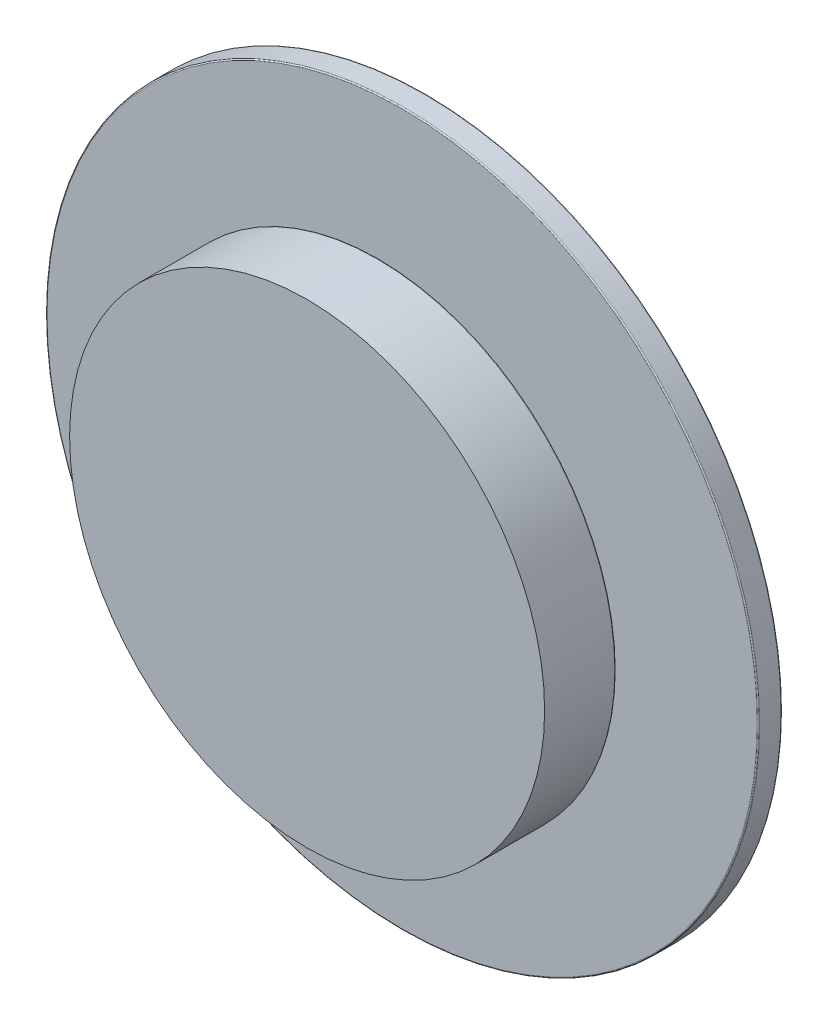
ISO-10303-21;
HEADER;
FILE_DESCRIPTION(('STEP AP214'),'2;1');
FILE_NAME('part.step','',(''),(''),'','','');
FILE_SCHEMA(('AUTOMOTIVE_DESIGN { 1 0 10303 214 1 1 1 1 }'));
ENDSEC;
DATA;
#1=APPLICATION_CONTEXT('core data for automotive mechanical design processes');
#2=APPLICATION_PROTOCOL_DEFINITION('international standard','automotive_design',2000,#1);
#3=PRODUCT_CONTEXT('',#1,'mechanical');
#4=PRODUCT('Part','Part','',(#3));
#5=PRODUCT_RELATED_PRODUCT_CATEGORY('part','',(#4));
#6=PRODUCT_DEFINITION_FORMATION('','',#4);
#7=PRODUCT_DEFINITION_CONTEXT('part definition',#1,'design');
#8=PRODUCT_DEFINITION('design','',#6,#7);
#9=PRODUCT_DEFINITION_SHAPE('','',#8);
#10=(LENGTH_UNIT() NAMED_UNIT(*) SI_UNIT(.MILLI.,.METRE.));
#11=(NAMED_UNIT(*) PLANE_ANGLE_UNIT() SI_UNIT($,.RADIAN.));
#12=(NAMED_UNIT(*) SI_UNIT($,.STERADIAN.) SOLID_ANGLE_UNIT());
#13=UNCERTAINTY_MEASURE_WITH_UNIT(LENGTH_MEASURE(1.E-05),#10,'distance_accuracy_value','');
#14=(GEOMETRIC_REPRESENTATION_CONTEXT(3) GLOBAL_UNCERTAINTY_ASSIGNED_CONTEXT((#13)) GLOBAL_UNIT_ASSIGNED_CONTEXT((#10,
#11,#12)) REPRESENTATION_CONTEXT('',''));
#15=CARTESIAN_POINT('',(0.,0.,0.));
#16=DIRECTION('',(0.,0.,1.));
#17=DIRECTION('',(1.,0.,0.));
#18=AXIS2_PLACEMENT_3D('',#15,#16,#17);
#19=CARTESIAN_POINT('',(-26.0528594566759,5.69906300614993,260.));
#20=DIRECTION('',(0.,0.,1.));
#21=DIRECTION('',(1.,0.,0.));
#22=AXIS2_PLACEMENT_3D('',#19,#20,#21);
#23=CYLINDRICAL_SURFACE('',#22,5.);
#24=CARTESIAN_POINT('',(-26.0528594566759,5.69906300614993,260.));
#25=DIRECTION('',(0.,0.,-1.));
#26=DIRECTION('',(-1.,0.,0.));
#27=AXIS2_PLACEMENT_3D('',#24,#25,#26);
#28=CIRCLE('',#27,5.);
#29=CARTESIAN_POINT('',(-31.0528594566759,5.69906300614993,260.));
#30=VERTEX_POINT('',#29);
#31=EDGE_CURVE('P0_E10',#30,#30,#28,.T.);
#32=ORIENTED_EDGE('',*,*,#31,.F.);
#33=EDGE_LOOP('',(#32));
#34=FACE_BOUND('',#33,.T.);
#35=CARTESIAN_POINT('',(-26.0528594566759,5.69906300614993,300.));
#36=DIRECTION('',(0.,0.,-1.));
#37=DIRECTION('',(-1.,0.,0.));
#38=AXIS2_PLACEMENT_3D('',#35,#36,#37);
#39=CIRCLE('',#38,5.);
#40=CARTESIAN_POINT('',(-31.0528594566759,5.69906300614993,300.));
#41=VERTEX_POINT('',#40);
#42=EDGE_CURVE('P0_E18',#41,#41,#39,.T.);
#43=ORIENTED_EDGE('',*,*,#42,.T.);
#44=EDGE_LOOP('',(#43));
#45=FACE_BOUND('',#44,.T.);
#46=ADVANCED_FACE('P0_F15',(#34,#45),#23,.T.);
#47=CARTESIAN_POINT('',(-26.0528594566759,5.69906300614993,260.));
#48=DIRECTION('',(0.,0.,-1.));
#49=DIRECTION('',(-1.,0.,0.));
#50=AXIS2_PLACEMENT_3D('',#47,#48,#49);
#51=PLANE('',#50);
#52=ORIENTED_EDGE('',*,*,#31,.T.);
#53=EDGE_LOOP('',(#52));
#54=FACE_BOUND('',#53,.T.);
#55=ADVANCED_FACE('P0_F30',(#54),#51,.T.);
#56=CARTESIAN_POINT('',(-26.0528594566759,5.69906300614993,300.));
#57=DIRECTION('',(0.,0.,-1.));
#58=DIRECTION('',(-1.,0.,0.));
#59=AXIS2_PLACEMENT_3D('',#56,#57,#58);
#60=PLANE('',#59);
#61=ORIENTED_EDGE('',*,*,#42,.F.);
#62=EDGE_LOOP('',(#61));
#63=FACE_BOUND('',#62,.T.);
#64=ADVANCED_FACE('P0_F28',(#63),#60,.F.);
#65=CLOSED_SHELL('',(#46,#55,#64));
#66=MANIFOLD_SOLID_BREP('P0_B1',#65);
#67=CARTESIAN_POINT('',(-26.0528594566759,5.69906300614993,290.));
#68=DIRECTION('',(0.,0.,1.));
#69=DIRECTION('',(1.,0.,0.));
#70=AXIS2_PLACEMENT_3D('',#67,#68,#69);
#71=PLANE('',#70);
#72=CARTESIAN_POINT('',(-26.0528594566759,5.69906300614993,290.));
#73=DIRECTION('',(0.,0.,1.));
#74=DIRECTION('',(1.,0.,0.));
#75=AXIS2_PLACEMENT_3D('',#72,#73,#74);
#76=CIRCLE('',#75,149.5);
#77=CARTESIAN_POINT('',(123.447140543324,5.69906300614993,290.));
#78=VERTEX_POINT('',#77);
#79=EDGE_CURVE('P1_E10',#78,#78,#76,.F.);
#80=ORIENTED_EDGE('',*,*,#79,.T.);
#81=EDGE_LOOP('',(#80));
#82=FACE_BOUND('',#81,.T.);
#83=CARTESIAN_POINT('',(-26.0528594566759,5.69906300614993,290.));
#84=DIRECTION('',(0.,0.,-1.));
#85=DIRECTION('',(-1.,0.,0.));
#86=AXIS2_PLACEMENT_3D('',#83,#84,#85);
#87=CIRCLE('',#86,5.);
#88=CARTESIAN_POINT('',(-31.0528594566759,5.69906300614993,290.));
#89=VERTEX_POINT('',#88);
#90=EDGE_CURVE('P1_E36',#89,#89,#87,.T.);
#91=ORIENTED_EDGE('',*,*,#90,.F.);
#92=EDGE_LOOP('',(#91));
#93=FACE_BOUND('',#92,.T.);
#94=ADVANCED_FACE('P1_F15',(#82,#93),#71,.F.);
#95=CARTESIAN_POINT('',(-26.0528594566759,5.69906300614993,300.));
#96=DIRECTION('',(0.,0.,1.));
#97=DIRECTION('',(1.,0.,0.));
#98=AXIS2_PLACEMENT_3D('',#95,#96,#97);
#99=CYLINDRICAL_SURFACE('',#98,150.);
#100=CARTESIAN_POINT('',(-26.0528594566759,5.69906300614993,299.5));
#101=DIRECTION('',(0.,0.,-1.));
#102=DIRECTION('',(-1.,0.,0.));
#103=AXIS2_PLACEMENT_3D('',#100,#101,#102);
#104=CIRCLE('',#103,150.);
#105=CARTESIAN_POINT('',(-176.052859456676,5.69906300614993,299.5));
#106=VERTEX_POINT('',#105);
#107=EDGE_CURVE('P1_E22',#106,#106,#104,.T.);
#108=ORIENTED_EDGE('',*,*,#107,.T.);
#109=EDGE_LOOP('',(#108));
#110=FACE_BOUND('',#109,.T.);
#111=CARTESIAN_POINT('',(-26.0528594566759,5.69906300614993,290.5));
#112=DIRECTION('',(0.,0.,1.));
#113=DIRECTION('',(1.,0.,0.));
#114=AXIS2_PLACEMENT_3D('',#111,#112,#113);
#115=CIRCLE('',#114,150.);
#116=CARTESIAN_POINT('',(123.947140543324,5.69906300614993,290.5));
#117=VERTEX_POINT('',#116);
#118=EDGE_CURVE('P1_E26',#117,#117,#115,.T.);
#119=ORIENTED_EDGE('',*,*,#118,.T.);
#120=EDGE_LOOP('',(#119));
#121=FACE_BOUND('',#120,.T.);
#122=ADVANCED_FACE('P1_F52',(#110,#121),#99,.T.);
#123=CARTESIAN_POINT('',(-26.0528594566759,5.69906300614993,300.));
#124=DIRECTION('',(0.,0.,-1.));
#125=DIRECTION('',(-1.,0.,0.));
#126=AXIS2_PLACEMENT_3D('',#123,#124,#125);
#127=PLANE('',#126);
#128=CARTESIAN_POINT('',(-26.0528594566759,5.69906300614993,300.));
#129=DIRECTION('',(0.,0.,-1.));
#130=DIRECTION('',(-1.,0.,0.));
#131=AXIS2_PLACEMENT_3D('',#128,#129,#130);
#132=CIRCLE('',#131,149.5);
#133=CARTESIAN_POINT('',(-175.552859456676,5.69906300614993,300.));
#134=VERTEX_POINT('',#133);
#135=EDGE_CURVE('P1_E30',#134,#134,#132,.F.);
#136=ORIENTED_EDGE('',*,*,#135,.T.);
#137=EDGE_LOOP('',(#136));
#138=FACE_BOUND('',#137,.T.);
#139=CARTESIAN_POINT('',(-26.0528594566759,5.69906300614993,300.));
#140=DIRECTION('',(0.,0.,-1.));
#141=DIRECTION('',(-1.,0.,0.));
#142=AXIS2_PLACEMENT_3D('',#139,#140,#141);
#143=CIRCLE('',#142,5.);
#144=CARTESIAN_POINT('',(-31.0528594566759,5.69906300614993,300.));
#145=VERTEX_POINT('',#144);
#146=EDGE_CURVE('P1_E35',#145,#145,#143,.T.);
#147=ORIENTED_EDGE('',*,*,#146,.T.);
#148=EDGE_LOOP('',(#147));
#149=FACE_BOUND('',#148,.T.);
#150=ADVANCED_FACE('P1_F42',(#138,#149),#127,.F.);
#151=CARTESIAN_POINT('',(-26.0528594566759,5.69906300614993,300.));
#152=DIRECTION('',(0.,0.,-1.));
#153=DIRECTION('',(-1.,0.,0.));
#154=AXIS2_PLACEMENT_3D('',#151,#152,#153);
#155=CYLINDRICAL_SURFACE('',#154,5.);
#156=ORIENTED_EDGE('',*,*,#146,.F.);
#157=EDGE_LOOP('',(#156));
#158=FACE_BOUND('',#157,.T.);
#159=ORIENTED_EDGE('',*,*,#90,.T.);
#160=EDGE_LOOP('',(#159));
#161=FACE_BOUND('',#160,.T.);
#162=ADVANCED_FACE('P1_F44',(#158,#161),#155,.F.);
#163=CARTESIAN_POINT('',(-26.0528594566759,5.69906300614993,299.5));
#164=DIRECTION('',(0.,0.,-1.));
#165=DIRECTION('',(-1.,0.,0.));
#166=AXIS2_PLACEMENT_3D('',#163,#164,#165);
#167=TOROIDAL_SURFACE('',#166,149.5,0.5);
#168=ORIENTED_EDGE('',*,*,#107,.F.);
#169=EDGE_LOOP('',(#168));
#170=FACE_BOUND('',#169,.T.);
#171=ORIENTED_EDGE('',*,*,#135,.F.);
#172=EDGE_LOOP('',(#171));
#173=FACE_BOUND('',#172,.T.);
#174=ADVANCED_FACE('P1_F47',(#170,#173),#167,.T.);
#175=CARTESIAN_POINT('',(-26.0528594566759,5.69906300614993,290.5));
#176=DIRECTION('',(0.,0.,1.));
#177=DIRECTION('',(1.,0.,0.));
#178=AXIS2_PLACEMENT_3D('',#175,#176,#177);
#179=TOROIDAL_SURFACE('',#178,149.5,0.5);
#180=ORIENTED_EDGE('',*,*,#79,.F.);
#181=EDGE_LOOP('',(#180));
#182=FACE_BOUND('',#181,.T.);
#183=ORIENTED_EDGE('',*,*,#118,.F.);
#184=EDGE_LOOP('',(#183));
#185=FACE_BOUND('',#184,.T.);
#186=ADVANCED_FACE('P1_F17',(#182,#185),#179,.T.);
#187=CLOSED_SHELL('',(#94,#122,#150,#162,#174,#186));
#188=MANIFOLD_SOLID_BREP('P1_B1',#187);
#189=CARTESIAN_POINT('',(-26.0528594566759,5.69906300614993,340.));
#190=DIRECTION('',(0.,0.,-1.));
#191=DIRECTION('',(-1.,0.,0.));
#192=AXIS2_PLACEMENT_3D('',#189,#190,#191);
#193=CYLINDRICAL_SURFACE('',#192,100.);
#194=CARTESIAN_POINT('',(-26.0528594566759,5.69906300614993,310.5));
#195=DIRECTION('',(0.,0.,1.));
#196=DIRECTION('',(1.,0.,0.));
#197=AXIS2_PLACEMENT_3D('',#194,#195,#196);
#198=CIRCLE('',#197,100.);
#199=CARTESIAN_POINT('',(73.9471405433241,5.69906300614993,310.5));
#200=VERTEX_POINT('',#199);
#201=EDGE_CURVE('P2_E22',#200,#200,#198,.T.);
#202=ORIENTED_EDGE('',*,*,#201,.T.);
#203=EDGE_LOOP('',(#202));
#204=FACE_BOUND('',#203,.T.);
#205=CARTESIAN_POINT('',(-26.0528594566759,5.69906300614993,340.));
#206=DIRECTION('',(0.,0.,1.));
#207=DIRECTION('',(1.,0.,0.));
#208=AXIS2_PLACEMENT_3D('',#205,#206,#207);
#209=CIRCLE('',#208,100.);
#210=CARTESIAN_POINT('',(73.9471405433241,5.69906300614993,340.));
#211=VERTEX_POINT('',#210);
#212=EDGE_CURVE('P2_E30',#211,#211,#209,.T.);
#213=ORIENTED_EDGE('',*,*,#212,.F.);
#214=EDGE_LOOP('',(#213));
#215=FACE_BOUND('',#214,.T.);
#216=ADVANCED_FACE('P2_F15',(#204,#215),#193,.T.);
#217=CARTESIAN_POINT('',(-26.0528594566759,5.69906300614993,340.));
#218=DIRECTION('',(0.,0.,1.));
#219=DIRECTION('',(1.,0.,0.));
#220=AXIS2_PLACEMENT_3D('',#217,#218,#219);
#221=PLANE('',#220);
#222=ORIENTED_EDGE('',*,*,#212,.T.);
#223=EDGE_LOOP('',(#222));
#224=FACE_BOUND('',#223,.T.);
#225=ADVANCED_FACE('P2_F49',(#224),#221,.T.);
#226=CARTESIAN_POINT('',(-26.0528594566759,5.69906300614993,310.));
#227=DIRECTION('',(0.,0.,1.));
#228=DIRECTION('',(1.,0.,0.));
#229=AXIS2_PLACEMENT_3D('',#226,#227,#228);
#230=PLANE('',#229);
#231=CARTESIAN_POINT('',(-26.0528594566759,5.69906300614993,310.));
#232=DIRECTION('',(0.,0.,1.));
#233=DIRECTION('',(1.,0.,0.));
#234=AXIS2_PLACEMENT_3D('',#231,#232,#233);
#235=CIRCLE('',#234,99.5);
#236=CARTESIAN_POINT('',(73.4471405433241,5.69906300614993,310.));
#237=VERTEX_POINT('',#236);
#238=EDGE_CURVE('P2_E10',#237,#237,#235,.F.);
#239=ORIENTED_EDGE('',*,*,#238,.T.);
#240=EDGE_LOOP('',(#239));
#241=FACE_BOUND('',#240,.T.);
#242=CARTESIAN_POINT('',(-26.0528594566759,5.69906300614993,310.));
#243=DIRECTION('',(0.,0.,1.));
#244=DIRECTION('',(1.,0.,0.));
#245=AXIS2_PLACEMENT_3D('',#242,#243,#244);
#246=CIRCLE('',#245,5.);
#247=CARTESIAN_POINT('',(-21.0528594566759,5.69906300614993,310.));
#248=VERTEX_POINT('',#247);
#249=EDGE_CURVE('P2_E26',#248,#248,#246,.F.);
#250=ORIENTED_EDGE('',*,*,#249,.F.);
#251=EDGE_LOOP('',(#250));
#252=FACE_BOUND('',#251,.T.);
#253=ADVANCED_FACE('P2_F44',(#241,#252),#230,.F.);
#254=CARTESIAN_POINT('',(-26.0528594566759,5.69906300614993,300.));
#255=DIRECTION('',(0.,0.,1.));
#256=DIRECTION('',(1.,0.,0.));
#257=AXIS2_PLACEMENT_3D('',#254,#255,#256);
#258=CYLINDRICAL_SURFACE('',#257,5.);
#259=CARTESIAN_POINT('',(-26.0528594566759,5.69906300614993,300.));
#260=DIRECTION('',(0.,0.,-1.));
#261=DIRECTION('',(-1.,0.,0.));
#262=AXIS2_PLACEMENT_3D('',#259,#260,#261);
#263=CIRCLE('',#262,5.);
#264=CARTESIAN_POINT('',(-31.0528594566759,5.69906300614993,300.));
#265=VERTEX_POINT('',#264);
#266=EDGE_CURVE('P2_E35',#265,#265,#263,.T.);
#267=ORIENTED_EDGE('',*,*,#266,.F.);
#268=EDGE_LOOP('',(#267));
#269=FACE_BOUND('',#268,.T.);
#270=ORIENTED_EDGE('',*,*,#249,.T.);
#271=EDGE_LOOP('',(#270));
#272=FACE_BOUND('',#271,.T.);
#273=ADVANCED_FACE('P2_F41',(#269,#272),#258,.T.);
#274=CARTESIAN_POINT('',(-26.0528594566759,5.69906300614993,300.));
#275=DIRECTION('',(0.,0.,-1.));
#276=DIRECTION('',(-1.,0.,0.));
#277=AXIS2_PLACEMENT_3D('',#274,#275,#276);
#278=PLANE('',#277);
#279=ORIENTED_EDGE('',*,*,#266,.T.);
#280=EDGE_LOOP('',(#279));
#281=FACE_BOUND('',#280,.T.);
#282=ADVANCED_FACE('P2_F39',(#281),#278,.T.);
#283=CARTESIAN_POINT('',(-26.0528594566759,5.69906300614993,310.5));
#284=DIRECTION('',(0.,0.,1.));
#285=DIRECTION('',(1.,0.,0.));
#286=AXIS2_PLACEMENT_3D('',#283,#284,#285);
#287=TOROIDAL_SURFACE('',#286,99.5,0.5);
#288=ORIENTED_EDGE('',*,*,#238,.F.);
#289=EDGE_LOOP('',(#288));
#290=FACE_BOUND('',#289,.T.);
#291=ORIENTED_EDGE('',*,*,#201,.F.);
#292=EDGE_LOOP('',(#291));
#293=FACE_BOUND('',#292,.T.);
#294=ADVANCED_FACE('P2_F17',(#290,#293),#287,.T.);
#295=CLOSED_SHELL('',(#216,#225,#253,#273,#282,#294));
#296=MANIFOLD_SOLID_BREP('P2_B1',#295);
#297=CARTESIAN_POINT('',(-26.0528594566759,5.69906300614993,260.));
#298=DIRECTION('',(0.,0.,-1.));
#299=DIRECTION('',(0.0758891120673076,0.997116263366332,0.));
#300=AXIS2_PLACEMENT_3D('',#297,#298,#299);
#301=CYLINDRICAL_SURFACE('',#300,5.);
#302=CARTESIAN_POINT('',(-26.0528594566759,5.69906300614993,260.));
#303=DIRECTION('',(0.,0.,1.));
#304=DIRECTION('',(-0.0758891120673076,-0.997116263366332,0.));
#305=AXIS2_PLACEMENT_3D('',#302,#303,#304);
#306=CIRCLE('',#305,5.);
#307=CARTESIAN_POINT('',(-26.4323050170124,0.713481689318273,260.));
#308=VERTEX_POINT('',#307);
#309=EDGE_CURVE('P3_E9',#308,#308,#306,.T.);
#310=ORIENTED_EDGE('',*,*,#309,.F.);
#311=EDGE_LOOP('',(#310));
#312=FACE_BOUND('',#311,.T.);
#313=CARTESIAN_POINT('',(-26.0528594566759,5.69906300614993,240.));
#314=DIRECTION('',(0.,0.,1.));
#315=DIRECTION('',(-0.0758891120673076,-0.997116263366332,0.));
#316=AXIS2_PLACEMENT_3D('',#313,#314,#315);
#317=CIRCLE('',#316,5.);
#318=CARTESIAN_POINT('',(-26.4323050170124,0.713481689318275,240.));
#319=VERTEX_POINT('',#318);
#320=EDGE_CURVE('P3_E17',#319,#319,#317,.T.);
#321=ORIENTED_EDGE('',*,*,#320,.T.);
#322=EDGE_LOOP('',(#321));
#323=FACE_BOUND('',#322,.T.);
#324=ADVANCED_FACE('P3_F14',(#312,#323),#301,.T.);
#325=CARTESIAN_POINT('',(-26.0528594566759,5.69906300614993,260.));
#326=DIRECTION('',(0.,0.,1.));
#327=DIRECTION('',(-0.0758891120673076,-0.997116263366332,0.));
#328=AXIS2_PLACEMENT_3D('',#325,#326,#327);
#329=PLANE('',#328);
#330=CARTESIAN_POINT('',(-26.0528594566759,5.69906300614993,260.));
#331=DIRECTION('',(0.,0.,1.));
#332=DIRECTION('',(-0.0758891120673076,-0.997116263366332,0.));
#333=AXIS2_PLACEMENT_3D('',#330,#331,#332);
#334=CIRCLE('',#333,4.);
#335=CARTESIAN_POINT('',(-26.3564159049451,1.7105979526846,260.));
#336=VERTEX_POINT('',#335);
#337=EDGE_CURVE('P3_E26',#336,#336,#334,.T.);
#338=ORIENTED_EDGE('',*,*,#337,.F.);
#339=EDGE_LOOP('',(#338));
#340=FACE_BOUND('',#339,.T.);
#341=ORIENTED_EDGE('',*,*,#309,.T.);
#342=EDGE_LOOP('',(#341));
#343=FACE_BOUND('',#342,.T.);
#344=ADVANCED_FACE('P3_F41',(#340,#343),#329,.T.);
#345=CARTESIAN_POINT('',(-26.0528594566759,5.69906300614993,240.));
#346=DIRECTION('',(0.,0.,1.));
#347=DIRECTION('',(-0.0758891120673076,-0.997116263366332,0.));
#348=AXIS2_PLACEMENT_3D('',#345,#346,#347);
#349=PLANE('',#348);
#350=ORIENTED_EDGE('',*,*,#320,.F.);
#351=EDGE_LOOP('',(#350));
#352=FACE_BOUND('',#351,.T.);
#353=ADVANCED_FACE('P3_F37',(#352),#349,.F.);
#354=CARTESIAN_POINT('',(-26.0528594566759,5.69906300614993,250.));
#355=DIRECTION('',(0.,0.,1.));
#356=DIRECTION('',(-0.0758891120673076,-0.997116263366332,0.));
#357=AXIS2_PLACEMENT_3D('',#354,#355,#356);
#358=CYLINDRICAL_SURFACE('',#357,4.);
#359=CARTESIAN_POINT('',(-26.0528594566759,5.69906300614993,250.));
#360=DIRECTION('',(0.,0.,1.));
#361=DIRECTION('',(-0.0758891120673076,-0.997116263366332,0.));
#362=AXIS2_PLACEMENT_3D('',#359,#360,#361);
#363=CIRCLE('',#362,4.);
#364=CARTESIAN_POINT('',(-26.3564159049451,1.71059795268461,250.));
#365=VERTEX_POINT('',#364);
#366=EDGE_CURVE('P3_E24',#365,#365,#363,.T.);
#367=ORIENTED_EDGE('',*,*,#366,.F.);
#368=EDGE_LOOP('',(#367));
#369=FACE_BOUND('',#368,.T.);
#370=ORIENTED_EDGE('',*,*,#337,.T.);
#371=EDGE_LOOP('',(#370));
#372=FACE_BOUND('',#371,.T.);
#373=ADVANCED_FACE('P3_F34',(#369,#372),#358,.F.);
#374=CARTESIAN_POINT('',(-26.0528594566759,5.69906300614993,250.));
#375=DIRECTION('',(0.,0.,1.));
#376=DIRECTION('',(-0.0758891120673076,-0.997116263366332,0.));
#377=AXIS2_PLACEMENT_3D('',#374,#375,#376);
#378=PLANE('',#377);
#379=ORIENTED_EDGE('',*,*,#366,.T.);
#380=EDGE_LOOP('',(#379));
#381=FACE_BOUND('',#380,.T.);
#382=ADVANCED_FACE('P3_F32',(#381),#378,.T.);
#383=CLOSED_SHELL('',(#324,#344,#353,#373,#382));
#384=MANIFOLD_SOLID_BREP('P3_B1',#383);
#385=CARTESIAN_POINT('',(-26.0528594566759,5.69906300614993,239.5));
#386=DIRECTION('',(0.,0.,-1.));
#387=DIRECTION('',(0.997116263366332,-0.0758891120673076,0.));
#388=AXIS2_PLACEMENT_3D('',#385,#386,#387);
#389=PLANE('',#388);
#390=CARTESIAN_POINT('',(-26.0528594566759,5.69906300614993,239.5));
#391=DIRECTION('',(0.,0.,-1.));
#392=DIRECTION('',(0.997116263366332,-0.0758891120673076,0.));
#393=AXIS2_PLACEMENT_3D('',#390,#391,#392);
#394=CIRCLE('',#393,50.3735945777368);
#395=CARTESIAN_POINT('',(24.1754709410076,1.87625564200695,239.5));
#396=VERTEX_POINT('',#395);
#397=EDGE_CURVE('P4_E10',#396,#396,#394,.T.);
#398=ORIENTED_EDGE('',*,*,#397,.T.);
#399=EDGE_LOOP('',(#398));
#400=FACE_BOUND('',#399,.T.);
#401=ADVANCED_FACE('P4_F15',(#400),#389,.T.);
#402=CARTESIAN_POINT('',(-26.0528594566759,5.69906300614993,239.5));
#403=DIRECTION('',(0.,0.,1.));
#404=DIRECTION('',(-0.997116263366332,0.0758891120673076,0.));
#405=AXIS2_PLACEMENT_3D('',#402,#403,#404);
#406=CONICAL_SURFACE('',#405,50.3735945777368,0.718829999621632);
#407=CARTESIAN_POINT('',(-26.0528594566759,5.69906300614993,240.));
#408=DIRECTION('',(0.,0.,-1.));
#409=DIRECTION('',(0.997116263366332,-0.0758891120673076,0.));
#410=AXIS2_PLACEMENT_3D('',#407,#408,#409);
#411=CIRCLE('',#410,50.8110945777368);
#412=CARTESIAN_POINT('',(24.6117093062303,1.8430541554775,240.));
#413=VERTEX_POINT('',#412);
#414=EDGE_CURVE('P4_E21',#413,#413,#411,.T.);
#415=ORIENTED_EDGE('',*,*,#414,.T.);
#416=EDGE_LOOP('',(#415));
#417=FACE_BOUND('',#416,.T.);
#418=ORIENTED_EDGE('',*,*,#397,.F.);
#419=EDGE_LOOP('',(#418));
#420=FACE_BOUND('',#419,.T.);
#421=ADVANCED_FACE('P4_F27',(#417,#420),#406,.T.);
#422=CARTESIAN_POINT('',(-26.0528594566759,5.69906300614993,240.));
#423=DIRECTION('',(0.,0.,1.));
#424=DIRECTION('',(-0.997116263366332,0.0758891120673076,0.));
#425=AXIS2_PLACEMENT_3D('',#422,#423,#424);
#426=PLANE('',#425);
#427=ORIENTED_EDGE('',*,*,#414,.F.);
#428=EDGE_LOOP('',(#427));
#429=FACE_BOUND('',#428,.T.);
#430=ADVANCED_FACE('P4_F30',(#429),#426,.T.);
#431=CLOSED_SHELL('',(#401,#421,#430));
#432=MANIFOLD_SOLID_BREP('P4_B1',#431);
#433=CARTESIAN_POINT('',(-26.0528594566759,5.69906300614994,195.));
#434=DIRECTION('',(0.,0.,1.));
#435=DIRECTION('',(-0.0758891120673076,-0.997116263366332,0.));
#436=AXIS2_PLACEMENT_3D('',#433,#434,#435);
#437=PLANE('',#436);
#438=CARTESIAN_POINT('',(-26.0528594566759,5.69906300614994,195.));
#439=DIRECTION('',(0.,0.,1.));
#440=DIRECTION('',(-0.0758891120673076,-0.997116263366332,0.));
#441=AXIS2_PLACEMENT_3D('',#438,#439,#440);
#442=CIRCLE('',#441,2.85560214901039);
#443=CARTESIAN_POINT('',(-26.2695685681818,2.85169566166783,195.));
#444=VERTEX_POINT('',#443);
#445=EDGE_CURVE('P5_E30',#444,#444,#442,.F.);
#446=ORIENTED_EDGE('',*,*,#445,.T.);
#447=EDGE_LOOP('',(#446));
#448=FACE_BOUND('',#447,.T.);
#449=ADVANCED_FACE('P5_F15',(#448),#437,.F.);
#450=CARTESIAN_POINT('',(-26.0528594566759,5.69906300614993,245.));
#451=DIRECTION('',(0.,0.,1.));
#452=DIRECTION('',(-0.0758891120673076,-0.997116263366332,0.));
#453=AXIS2_PLACEMENT_3D('',#450,#451,#452);
#454=CONICAL_SURFACE('',#453,60.,0.841941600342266);
#455=CARTESIAN_POINT('',(-26.0528594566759,5.69906300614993,244.127031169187));
#456=DIRECTION('',(0.,0.,-1.));
#457=DIRECTION('',(0.0758891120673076,0.997116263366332,0.));
#458=AXIS2_PLACEMENT_3D('',#455,#456,#457);
#459=CIRCLE('',#458,59.0222749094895);
#460=CARTESIAN_POINT('',(-30.5320074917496,-53.1530072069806,244.127031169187));
#461=VERTEX_POINT('',#460);
#462=EDGE_CURVE('P5_E22',#461,#461,#459,.T.);
#463=CARTESIAN_POINT('',(-26.0528594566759,5.69906300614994,195.762187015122));
#464=DIRECTION('',(0.,0.,-1.));
#465=DIRECTION('',(0.0758891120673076,0.997116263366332,0.));
#466=AXIS2_PLACEMENT_3D('',#463,#464,#465);
#467=CIRCLE('',#466,4.85364945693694);
#468=CARTESIAN_POINT('',(-26.4211986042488,0.859410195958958,195.762187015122));
#469=VERTEX_POINT('',#468);
#470=EDGE_CURVE('P5_E26',#469,#469,#467,.F.);
#471=CARTESIAN_POINT('',(-30.5320074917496,-53.1530072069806,244.127031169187));
#472=CARTESIAN_POINT('',(-30.4891865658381,-52.5903778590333,243.623230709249));
#473=CARTESIAN_POINT('',(-30.4463656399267,-52.0277485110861,243.119430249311));
#474=CARTESIAN_POINT('',(-30.3607237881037,-50.9024898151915,242.111829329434));
#475=CARTESIAN_POINT('',(-30.3179028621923,-50.3398604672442,241.608028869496));
#476=CARTESIAN_POINT('',(-30.2322610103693,-49.2146017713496,240.60042794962));
#477=CARTESIAN_POINT('',(-30.1894400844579,-48.6519724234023,240.096627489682));
#478=CARTESIAN_POINT('',(-30.1037982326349,-47.5267137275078,239.089026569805));
#479=CARTESIAN_POINT('',(-30.0609773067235,-46.9640843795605,238.585226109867));
#480=CARTESIAN_POINT('',(-29.9753354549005,-45.8388256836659,237.577625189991));
#481=CARTESIAN_POINT('',(-29.9325145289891,-45.2761963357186,237.073824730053));
#482=CARTESIAN_POINT('',(-29.8468726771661,-44.150937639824,236.066223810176));
#483=CARTESIAN_POINT('',(-29.8040517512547,-43.5883082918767,235.562423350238));
#484=CARTESIAN_POINT('',(-29.7184098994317,-42.4630495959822,234.554822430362));
#485=CARTESIAN_POINT('',(-29.6755889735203,-41.9004202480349,234.051021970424));
#486=CARTESIAN_POINT('',(-29.5899471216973,-40.7751615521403,233.043421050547));
#487=CARTESIAN_POINT('',(-29.5471261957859,-40.212532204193,232.539620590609));
#488=CARTESIAN_POINT('',(-29.4614843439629,-39.0872735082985,231.532019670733));
#489=CARTESIAN_POINT('',(-29.4186634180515,-38.5246441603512,231.028219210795));
#490=CARTESIAN_POINT('',(-29.3330215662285,-37.3993854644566,230.020618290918));
#491=CARTESIAN_POINT('',(-29.2902006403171,-36.8367561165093,229.51681783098));
#492=CARTESIAN_POINT('',(-29.2045587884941,-35.7114974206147,228.509216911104));
#493=CARTESIAN_POINT('',(-29.1617378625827,-35.1488680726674,228.005416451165));
#494=CARTESIAN_POINT('',(-29.0760960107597,-34.0236093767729,226.997815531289));
#495=CARTESIAN_POINT('',(-29.0332750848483,-33.4609800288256,226.494015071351));
#496=CARTESIAN_POINT('',(-28.9476332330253,-32.335721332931,225.486414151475));
#497=CARTESIAN_POINT('',(-28.9048123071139,-31.7730919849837,224.982613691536));
#498=CARTESIAN_POINT('',(-28.8191704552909,-30.6478332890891,223.97501277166));
#499=CARTESIAN_POINT('',(-28.7763495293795,-30.0852039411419,223.471212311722));
#500=CARTESIAN_POINT('',(-28.6907076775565,-28.9599452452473,222.463611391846));
#501=CARTESIAN_POINT('',(-28.6478867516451,-28.3973158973,221.959810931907));
#502=CARTESIAN_POINT('',(-28.5622448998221,-27.2720572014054,220.952210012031));
#503=CARTESIAN_POINT('',(-28.5194239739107,-26.7094278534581,220.448409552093));
#504=CARTESIAN_POINT('',(-28.4337821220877,-25.5841691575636,219.440808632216));
#505=CARTESIAN_POINT('',(-28.3909611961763,-25.0215398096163,218.937008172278));
#506=CARTESIAN_POINT('',(-28.3053193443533,-23.8962811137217,217.929407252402));
#507=CARTESIAN_POINT('',(-28.2624984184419,-23.3336517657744,217.425606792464));
#508=CARTESIAN_POINT('',(-28.1768565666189,-22.2083930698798,216.418005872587));
#509=CARTESIAN_POINT('',(-28.1340356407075,-21.6457637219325,215.914205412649));
#510=CARTESIAN_POINT('',(-28.0483937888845,-20.520505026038,214.906604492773));
#511=CARTESIAN_POINT('',(-28.0055728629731,-19.9578756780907,214.402804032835));
#512=CARTESIAN_POINT('',(-27.9199310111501,-18.8326169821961,213.395203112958));
#513=CARTESIAN_POINT('',(-27.8771100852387,-18.2699876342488,212.89140265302));
#514=CARTESIAN_POINT('',(-27.7914682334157,-17.1447289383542,211.883801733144));
#515=CARTESIAN_POINT('',(-27.7486473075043,-16.582099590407,211.380001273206));
#516=CARTESIAN_POINT('',(-27.6630054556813,-15.4568408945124,210.372400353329));
#517=CARTESIAN_POINT('',(-27.6201845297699,-14.8942115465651,209.868599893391));
#518=CARTESIAN_POINT('',(-27.5345426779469,-13.7689528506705,208.860998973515));
#519=CARTESIAN_POINT('',(-27.4917217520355,-13.2063235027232,208.357198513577));
#520=CARTESIAN_POINT('',(-27.4060799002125,-12.0810648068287,207.3495975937));
#521=CARTESIAN_POINT('',(-27.3632589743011,-11.5184354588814,206.845797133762));
#522=CARTESIAN_POINT('',(-27.2776171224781,-10.3931767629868,205.838196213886));
#523=CARTESIAN_POINT('',(-27.2347961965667,-9.8305474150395,205.334395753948));
#524=CARTESIAN_POINT('',(-27.1491543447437,-8.70528871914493,204.326794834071));
#525=CARTESIAN_POINT('',(-27.1063334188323,-8.14265937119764,203.822994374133));
#526=CARTESIAN_POINT('',(-27.0206915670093,-7.01740067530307,202.815393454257));
#527=CARTESIAN_POINT('',(-26.9778706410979,-6.45477132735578,202.311592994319));
#528=CARTESIAN_POINT('',(-26.8922287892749,-5.32951263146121,201.303992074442));
#529=CARTESIAN_POINT('',(-26.8494078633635,-4.76688328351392,200.800191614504));
#530=CARTESIAN_POINT('',(-26.7637660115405,-3.64162458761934,199.792590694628));
#531=CARTESIAN_POINT('',(-26.7209450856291,-3.07899523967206,199.288790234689));
#532=CARTESIAN_POINT('',(-26.6353032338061,-1.95373654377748,198.281189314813));
#533=CARTESIAN_POINT('',(-26.5924823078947,-1.39110719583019,197.777388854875));
#534=CARTESIAN_POINT('',(-26.5068404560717,-0.265848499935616,196.769787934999));
#535=CARTESIAN_POINT('',(-26.4640195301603,0.296780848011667,196.26598747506));
#536=CARTESIAN_POINT('',(-26.4211986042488,0.859410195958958,195.762187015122));
#537=B_SPLINE_CURVE_WITH_KNOTS('',3,(#471,#472,#473,#474,#475,#476,#477,#478,#479,#480,#481,
#482,#483,#484,#485,#486,#487,#488,#489,#490,#491,#492,#493,#494,#495,#496,#497,#498,#499,#500,
#501,#502,#503,#504,#505,#506,#507,#508,#509,#510,#511,#512,#513,#514,#515,#516,#517,#518,#519,
#520,#521,#522,#523,#524,#525,#526,#527,#528,#529,#530,#531,#532,#533,#534,#535,#536),
.UNSPECIFIED.,.F.,.F.,(4,2,2,2,2,2,2,2,2,2,2,2,2,2,2,2,2,2,2,2,2,2,2,2,2,2,2,2,2,2,2,2,4),(0.,
2.26931770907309,4.5386354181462,6.80795312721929,9.0772708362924,11.3465885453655,
13.6159062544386,15.8852239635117,18.1545416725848,20.4238593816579,22.693177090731,
24.9624947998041,27.2318125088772,29.5011302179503,31.7704479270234,34.0397656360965,
36.3090833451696,38.5784010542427,40.8477187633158,43.1170364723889,45.386354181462,
47.6556718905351,49.9249895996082,52.1943073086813,54.4636250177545,56.7329427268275,
59.0022604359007,61.2715781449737,63.5408958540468,65.81021356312,68.0795312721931,
70.3488489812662,72.6181666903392),.UNSPECIFIED.);
#538=EDGE_CURVE('P5_BSEAM56',#461,#469,#537,.T.);
#539=ORIENTED_EDGE('',*,*,#462,.T.);
#540=ORIENTED_EDGE('',*,*,#470,.T.);
#541=ORIENTED_EDGE('',*,*,#538,.T.);
#542=ORIENTED_EDGE('',*,*,#538,.F.);
#543=EDGE_LOOP('',(#539,#541,#540,#542));
#544=FACE_BOUND('',#543,.T.);
#545=ADVANCED_FACE('P5_F56',(#544),#454,.T.);
#546=CARTESIAN_POINT('',(-85.8798352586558,10.2524097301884,245.));
#547=DIRECTION('',(0.,0.,-1.));
#548=DIRECTION('',(0.0758891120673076,0.997116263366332,0.));
#549=AXIS2_PLACEMENT_3D('',#546,#547,#548);
#550=PLANE('',#549);
#551=CARTESIAN_POINT('',(-26.0528594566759,5.69906300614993,245.));
#552=DIRECTION('',(0.,0.,-1.));
#553=DIRECTION('',(0.0758891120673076,0.997116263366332,0.));
#554=AXIS2_PLACEMENT_3D('',#551,#552,#553);
#555=CIRCLE('',#554,58.6892670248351);
#556=CARTESIAN_POINT('',(-21.5989830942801,64.2190856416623,245.));
#557=VERTEX_POINT('',#556);
#558=EDGE_CURVE('P5_E10',#557,#557,#555,.F.);
#559=ORIENTED_EDGE('',*,*,#558,.T.);
#560=EDGE_LOOP('',(#559));
#561=FACE_BOUND('',#560,.T.);
#562=CARTESIAN_POINT('',(-26.0528594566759,5.69906300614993,245.));
#563=DIRECTION('',(0.,0.,-1.));
#564=DIRECTION('',(0.0758891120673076,0.997116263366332,0.));
#565=AXIS2_PLACEMENT_3D('',#562,#563,#564);
#566=CIRCLE('',#565,56.9970680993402);
#567=CARTESIAN_POINT('',(-30.3783163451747,-51.1336405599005,245.));
#568=VERTEX_POINT('',#567);
#569=EDGE_CURVE('P5_E36',#568,#568,#566,.T.);
#570=ORIENTED_EDGE('',*,*,#569,.T.);
#571=EDGE_LOOP('',(#570));
#572=FACE_BOUND('',#571,.T.);
#573=ADVANCED_FACE('P5_F47',(#561,#572),#550,.F.);
#574=CARTESIAN_POINT('',(-26.0528594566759,5.69906300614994,197.));
#575=DIRECTION('',(0.,0.,1.));
#576=DIRECTION('',(-0.0758891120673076,-0.997116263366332,0.));
#577=AXIS2_PLACEMENT_3D('',#574,#575,#576);
#578=PLANE('',#577);
#579=CARTESIAN_POINT('',(-26.0528594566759,5.69906300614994,197.));
#580=DIRECTION('',(0.,0.,1.));
#581=DIRECTION('',(-0.0758891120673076,-0.997116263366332,0.));
#582=AXIS2_PLACEMENT_3D('',#579,#580,#581);
#583=CIRCLE('',#582,3.23706809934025);
#584=CARTESIAN_POINT('',(-26.2985176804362,2.47132975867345,197.));
#585=VERTEX_POINT('',#584);
#586=EDGE_CURVE('P5_E35',#585,#585,#583,.F.);
#587=ORIENTED_EDGE('',*,*,#586,.F.);
#588=EDGE_LOOP('',(#587));
#589=FACE_BOUND('',#588,.T.);
#590=ADVANCED_FACE('P5_F45',(#589),#578,.T.);
#591=CARTESIAN_POINT('',(-26.0528594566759,5.69906300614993,246.491875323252));
#592=DIRECTION('',(0.,0.,1.));
#593=DIRECTION('',(-0.0758891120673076,-0.997116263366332,0.));
#594=AXIS2_PLACEMENT_3D('',#591,#592,#593);
#595=CONICAL_SURFACE('',#594,58.6679684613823,0.841941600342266);
#596=CARTESIAN_POINT('',(-26.2985176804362,2.47132975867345,197.));
#597=CARTESIAN_POINT('',(-26.3410155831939,1.9129446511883,197.5));
#598=CARTESIAN_POINT('',(-26.3835134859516,1.35455954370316,198.));
#599=CARTESIAN_POINT('',(-26.468509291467,0.237789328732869,199.));
#600=CARTESIAN_POINT('',(-26.5110071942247,-0.320595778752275,199.5));
#601=CARTESIAN_POINT('',(-26.5960029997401,-1.43736599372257,200.5));
#602=CARTESIAN_POINT('',(-26.6385009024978,-1.99575110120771,201.));
#603=CARTESIAN_POINT('',(-26.7234967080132,-3.112521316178,202.));
#604=CARTESIAN_POINT('',(-26.7659946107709,-3.67090642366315,202.5));
#605=CARTESIAN_POINT('',(-26.8509904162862,-4.78767663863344,203.5));
#606=CARTESIAN_POINT('',(-26.8934883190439,-5.34606174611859,204.));
#607=CARTESIAN_POINT('',(-26.9784841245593,-6.46283196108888,205.));
#608=CARTESIAN_POINT('',(-27.020982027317,-7.02121706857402,205.5));
#609=CARTESIAN_POINT('',(-27.1059778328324,-8.13798728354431,206.5));
#610=CARTESIAN_POINT('',(-27.1484757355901,-8.69637239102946,207.));
#611=CARTESIAN_POINT('',(-27.2334715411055,-9.81314260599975,208.));
#612=CARTESIAN_POINT('',(-27.2759694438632,-10.3715277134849,208.5));
#613=CARTESIAN_POINT('',(-27.3609652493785,-11.4882979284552,209.5));
#614=CARTESIAN_POINT('',(-27.4034631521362,-12.0466830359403,210.));
#615=CARTESIAN_POINT('',(-27.4884589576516,-13.1634532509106,211.));
#616=CARTESIAN_POINT('',(-27.5309568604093,-13.7218383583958,211.5));
#617=CARTESIAN_POINT('',(-27.6159526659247,-14.8386085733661,212.5));
#618=CARTESIAN_POINT('',(-27.6584505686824,-15.3969936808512,213.));
#619=CARTESIAN_POINT('',(-27.7434463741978,-16.5137638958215,214.));
#620=CARTESIAN_POINT('',(-27.7859442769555,-17.0721490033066,214.5));
#621=CARTESIAN_POINT('',(-27.8709400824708,-18.1889192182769,215.5));
#622=CARTESIAN_POINT('',(-27.9134379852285,-18.7473043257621,216.));
#623=CARTESIAN_POINT('',(-27.9984337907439,-19.8640745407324,217.));
#624=CARTESIAN_POINT('',(-28.0409316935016,-20.4224596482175,217.5));
#625=CARTESIAN_POINT('',(-28.125927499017,-21.5392298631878,218.5));
#626=CARTESIAN_POINT('',(-28.1684254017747,-22.097614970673,219.));
#627=CARTESIAN_POINT('',(-28.2534212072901,-23.2143851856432,220.));
#628=CARTESIAN_POINT('',(-28.2959191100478,-23.7727702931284,220.5));
#629=CARTESIAN_POINT('',(-28.3809149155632,-24.8895405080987,221.5));
#630=CARTESIAN_POINT('',(-28.4234128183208,-25.4479256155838,222.));
#631=CARTESIAN_POINT('',(-28.5084086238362,-26.5646958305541,223.));
#632=CARTESIAN_POINT('',(-28.5509065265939,-27.1230809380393,223.5));
#633=CARTESIAN_POINT('',(-28.6359023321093,-28.2398511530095,224.5));
#634=CARTESIAN_POINT('',(-28.678400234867,-28.7982362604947,225.));
#635=CARTESIAN_POINT('',(-28.7633960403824,-29.915006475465,226.));
#636=CARTESIAN_POINT('',(-28.8058939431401,-30.4733915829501,226.5));
#637=CARTESIAN_POINT('',(-28.8908897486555,-31.5901617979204,227.5));
#638=CARTESIAN_POINT('',(-28.9333876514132,-32.1485469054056,228.));
#639=CARTESIAN_POINT('',(-29.0183834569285,-33.2653171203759,229.));
#640=CARTESIAN_POINT('',(-29.0608813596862,-33.823702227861,229.5));
#641=CARTESIAN_POINT('',(-29.1458771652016,-34.9404724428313,230.5));
#642=CARTESIAN_POINT('',(-29.1883750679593,-35.4988575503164,231.));
#643=CARTESIAN_POINT('',(-29.2733708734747,-36.6156277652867,232.));
#644=CARTESIAN_POINT('',(-29.3158687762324,-37.1740128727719,232.5));
#645=CARTESIAN_POINT('',(-29.4008645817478,-38.2907830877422,233.5));
#646=CARTESIAN_POINT('',(-29.4433624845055,-38.8491681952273,234.));
#647=CARTESIAN_POINT('',(-29.5283582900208,-39.9659384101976,235.));
#648=CARTESIAN_POINT('',(-29.5708561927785,-40.5243235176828,235.5));
#649=CARTESIAN_POINT('',(-29.6558519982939,-41.6410937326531,236.5));
#650=CARTESIAN_POINT('',(-29.6983499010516,-42.1994788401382,237.));
#651=CARTESIAN_POINT('',(-29.783345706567,-43.3162490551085,238.));
#652=CARTESIAN_POINT('',(-29.8258436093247,-43.8746341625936,238.5));
#653=CARTESIAN_POINT('',(-29.9108394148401,-44.9914043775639,239.5));
#654=CARTESIAN_POINT('',(-29.9533373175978,-45.5497894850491,240.));
#655=CARTESIAN_POINT('',(-30.0383331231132,-46.6665597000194,241.));
#656=CARTESIAN_POINT('',(-30.0808310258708,-47.2249448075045,241.5));
#657=CARTESIAN_POINT('',(-30.1658268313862,-48.3417150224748,242.5));
#658=CARTESIAN_POINT('',(-30.2083247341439,-48.9001001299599,243.));
#659=CARTESIAN_POINT('',(-30.2933205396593,-50.0168703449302,244.));
#660=CARTESIAN_POINT('',(-30.335818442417,-50.5752554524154,244.5));
#661=CARTESIAN_POINT('',(-30.3783163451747,-51.1336405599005,245.));
#662=B_SPLINE_CURVE_WITH_KNOTS('',3,(#596,#597,#598,#599,#600,#601,#602,#603,#604,#605,#606,
#607,#608,#609,#610,#611,#612,#613,#614,#615,#616,#617,#618,#619,#620,#621,#622,#623,#624,#625,
#626,#627,#628,#629,#630,#631,#632,#633,#634,#635,#636,#637,#638,#639,#640,#641,#642,#643,#644,
#645,#646,#647,#648,#649,#650,#651,#652,#653,#654,#655,#656,#657,#658,#659,#660,#661),
.UNSPECIFIED.,.F.,.F.,(4,2,2,2,2,2,2,2,2,2,2,2,2,2,2,2,2,2,2,2,2,2,2,2,2,2,2,2,2,2,2,2,4),(0.,
2.25219892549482,4.50439785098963,6.75659677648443,9.00879570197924,11.2609946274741,
13.5131935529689,15.7653924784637,18.0175914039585,20.2697903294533,22.5219892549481,
24.774188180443,27.0263871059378,29.2785860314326,31.5307849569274,33.7829838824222,
36.035182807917,38.2873817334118,40.5395806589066,42.7917795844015,45.0439785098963,
47.2961774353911,49.5483763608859,51.8005752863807,54.0527742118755,56.3049731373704,
58.5571720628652,60.80937098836,63.0615699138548,65.3137688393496,67.5659677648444,
69.8181666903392,72.070365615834),.UNSPECIFIED.);
#663=EDGE_CURVE('P5_BSEAM42',#585,#568,#662,.T.);
#664=ORIENTED_EDGE('',*,*,#586,.T.);
#665=ORIENTED_EDGE('',*,*,#569,.F.);
#666=ORIENTED_EDGE('',*,*,#663,.T.);
#667=ORIENTED_EDGE('',*,*,#663,.F.);
#668=EDGE_LOOP('',(#664,#666,#665,#667));
#669=FACE_BOUND('',#668,.T.);
#670=ADVANCED_FACE('P5_F42',(#669),#595,.F.);
#671=CARTESIAN_POINT('',(-26.0528594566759,5.69906300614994,198.));
#672=DIRECTION('',(0.,0.,1.));
#673=DIRECTION('',(-0.0758891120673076,-0.997116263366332,0.));
#674=AXIS2_PLACEMENT_3D('',#671,#672,#673);
#675=DEGENERATE_TOROIDAL_SURFACE('',#674,2.85560214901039,3.,.T.);
#676=ORIENTED_EDGE('',*,*,#470,.F.);
#677=EDGE_LOOP('',(#676));
#678=FACE_BOUND('',#677,.T.);
#679=ORIENTED_EDGE('',*,*,#445,.F.);
#680=EDGE_LOOP('',(#679));
#681=FACE_BOUND('',#680,.T.);
#682=ADVANCED_FACE('P5_F54',(#678,#681),#675,.T.);
#683=CARTESIAN_POINT('',(-26.0528594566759,5.69906300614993,244.5));
#684=DIRECTION('',(0.,0.,-1.));
#685=DIRECTION('',(0.0758891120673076,0.997116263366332,0.));
#686=AXIS2_PLACEMENT_3D('',#683,#684,#685);
#687=TOROIDAL_SURFACE('',#686,58.6892670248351,0.5);
#688=ORIENTED_EDGE('',*,*,#558,.F.);
#689=EDGE_LOOP('',(#688));
#690=FACE_BOUND('',#689,.T.);
#691=ORIENTED_EDGE('',*,*,#462,.F.);
#692=EDGE_LOOP('',(#691));
#693=FACE_BOUND('',#692,.T.);
#694=ADVANCED_FACE('P5_F17',(#690,#693),#687,.T.);
#695=CLOSED_SHELL('',(#449,#545,#573,#590,#670,#682,#694));
#696=MANIFOLD_SOLID_BREP('P5_B1',#695);
#697=ADVANCED_BREP_SHAPE_REPRESENTATION('',(#18,#66,#188,#296,#384,#432,#696),#14);
#698=SHAPE_DEFINITION_REPRESENTATION(#9,#697);
ENDSEC;
END-ISO-10303-21;
